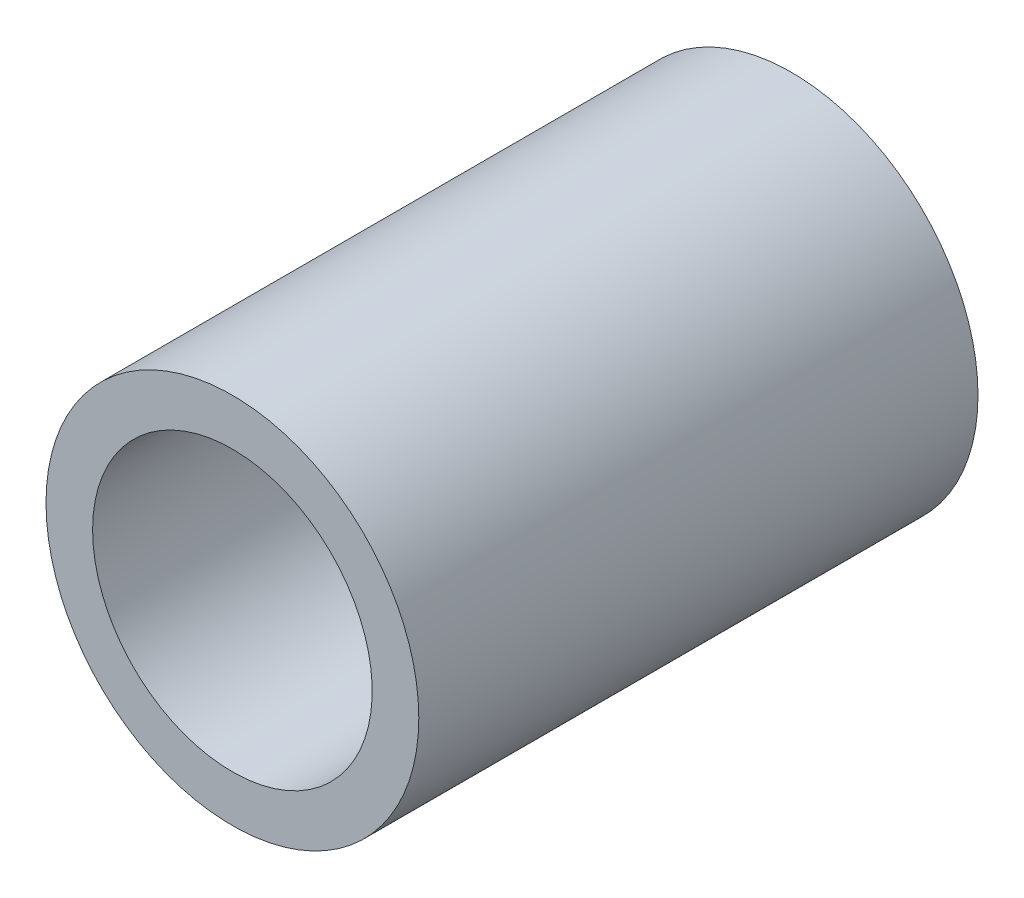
from build123d import *

# Parameters (mm, degrees)
ESQUISSE1_R        = 20
ESQUISSE1_R_2      = 15
EXTRU_MINCE1_DEPTH = 60


with BuildPart() as part:
    # Esquisse1 → Extru.-Mince1 (new body)
    with BuildSketch(Plane.XY):
        Circle(ESQUISSE1_R)
        Circle(ESQUISSE1_R_2, mode=Mode.SUBTRACT)
    extrude(amount=EXTRU_MINCE1_DEPTH)


solid = part.part
